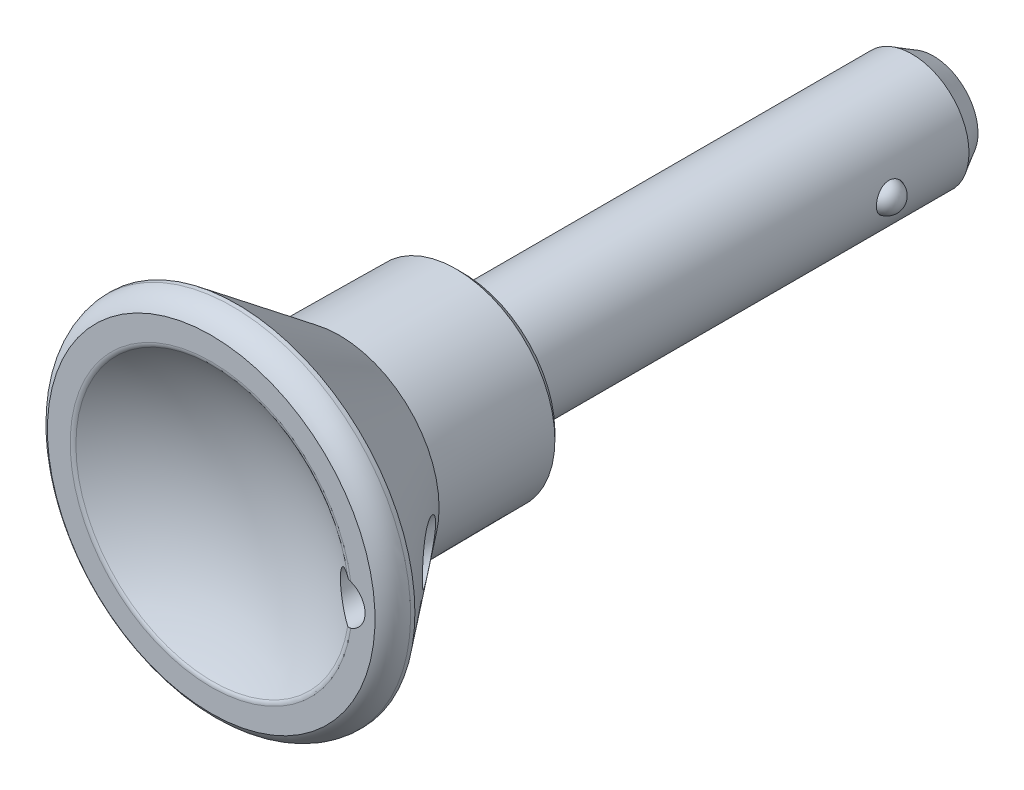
ISO-10303-21;
HEADER;
FILE_DESCRIPTION(('STEP AP214'),'2;1');
FILE_NAME('part.step','',(''),(''),'','','');
FILE_SCHEMA(('AUTOMOTIVE_DESIGN { 1 0 10303 214 1 1 1 1 }'));
ENDSEC;
DATA;
#1=APPLICATION_CONTEXT('core data for automotive mechanical design processes');
#2=APPLICATION_PROTOCOL_DEFINITION('international standard','automotive_design',2000,#1);
#3=PRODUCT_CONTEXT('',#1,'mechanical');
#4=PRODUCT('Part','Part','',(#3));
#5=PRODUCT_RELATED_PRODUCT_CATEGORY('part','',(#4));
#6=PRODUCT_DEFINITION_FORMATION('','',#4);
#7=PRODUCT_DEFINITION_CONTEXT('part definition',#1,'design');
#8=PRODUCT_DEFINITION('design','',#6,#7);
#9=PRODUCT_DEFINITION_SHAPE('','',#8);
#10=(LENGTH_UNIT() NAMED_UNIT(*) SI_UNIT(.MILLI.,.METRE.));
#11=(NAMED_UNIT(*) PLANE_ANGLE_UNIT() SI_UNIT($,.RADIAN.));
#12=(NAMED_UNIT(*) SI_UNIT($,.STERADIAN.) SOLID_ANGLE_UNIT());
#13=UNCERTAINTY_MEASURE_WITH_UNIT(LENGTH_MEASURE(1.E-05),#10,'distance_accuracy_value','');
#14=(GEOMETRIC_REPRESENTATION_CONTEXT(3) GLOBAL_UNCERTAINTY_ASSIGNED_CONTEXT((#13)) GLOBAL_UNIT_ASSIGNED_CONTEXT((#10,
#11,#12)) REPRESENTATION_CONTEXT('',''));
#15=CARTESIAN_POINT('',(0.,0.,0.));
#16=DIRECTION('',(0.,0.,1.));
#17=DIRECTION('',(1.,0.,0.));
#18=AXIS2_PLACEMENT_3D('',#15,#16,#17);
#19=CARTESIAN_POINT('',(0.,0.,0.));
#20=DIRECTION('',(0.,0.,1.));
#21=DIRECTION('',(0.,-1.,0.));
#22=AXIS2_PLACEMENT_3D('',#19,#20,#21);
#23=CYLINDRICAL_SURFACE('',#22,4.);
#24=CARTESIAN_POINT('',(0.,0.,0.));
#25=DIRECTION('',(0.,0.,1.));
#26=DIRECTION('',(0.,-1.,0.));
#27=AXIS2_PLACEMENT_3D('',#24,#25,#26);
#28=CIRCLE('',#27,4.);
#29=CARTESIAN_POINT('',(0.,-4.,0.));
#30=VERTEX_POINT('',#29);
#31=EDGE_CURVE('E18',#30,#30,#28,.T.);
#32=ORIENTED_EDGE('',*,*,#31,.F.);
#33=EDGE_LOOP('',(#32));
#34=FACE_BOUND('',#33,.T.);
#35=CARTESIAN_POINT('',(0.,0.,-31.5));
#36=DIRECTION('',(0.,0.,1.));
#37=DIRECTION('',(1.,0.,0.));
#38=AXIS2_PLACEMENT_3D('',#35,#36,#37);
#39=CIRCLE('',#38,4.);
#40=CARTESIAN_POINT('',(4.,0.,-31.5));
#41=VERTEX_POINT('',#40);
#42=EDGE_CURVE('E118',#41,#41,#39,.T.);
#43=ORIENTED_EDGE('',*,*,#42,.T.);
#44=EDGE_LOOP('',(#43));
#45=FACE_BOUND('',#44,.T.);
#46=CARTESIAN_POINT('',(3.88177455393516,0.965311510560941,-25.7388991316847));
#47=CARTESIAN_POINT('',(3.87947589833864,0.974537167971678,-25.7717537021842));
#48=CARTESIAN_POINT('',(3.87758596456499,0.982015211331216,-25.805105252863));
#49=CARTESIAN_POINT('',(3.87470673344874,0.993322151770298,-25.8719408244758));
#50=CARTESIAN_POINT('',(3.8737042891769,0.997204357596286,-25.9054152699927));
#51=CARTESIAN_POINT('',(3.87228725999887,1.00270077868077,-25.9925132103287));
#52=CARTESIAN_POINT('',(3.87257020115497,1.00161876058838,-26.0463531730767));
#53=CARTESIAN_POINT('',(3.87471439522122,0.993273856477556,-26.1269570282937));
#54=CARTESIAN_POINT('',(3.87573945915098,0.989279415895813,-26.1541316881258));
#55=CARTESIAN_POINT('',(3.87834788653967,0.97900141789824,-26.2080101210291));
#56=CARTESIAN_POINT('',(3.87993110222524,0.972718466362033,-26.2347140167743));
#57=CARTESIAN_POINT('',(3.88177455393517,0.965311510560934,-26.2611008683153));
#58=B_SPLINE_CURVE_WITH_KNOTS('',3,(#46,#47,#48,#49,#50,#51,#52,#53,#54,#55,#56,#57),
.UNSPECIFIED.,.F.,.F.,(4,2,2,2,2,4),(0.,0.10251399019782,0.203482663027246,0.364121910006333,
0.446491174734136,0.528838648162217),.UNSPECIFIED.);
#59=CARTESIAN_POINT('',(3.88177451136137,0.965311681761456,-25.7388997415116));
#60=VERTEX_POINT('',#59);
#61=CARTESIAN_POINT('',(3.88177446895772,0.965311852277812,-26.2610996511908));
#62=VERTEX_POINT('',#61);
#63=EDGE_CURVE('E73',#60,#62,#58,.T.);
#64=ORIENTED_EDGE('',*,*,#63,.T.);
#65=CARTESIAN_POINT('',(3.88177448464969,0.965311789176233,-26.2610998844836));
#66=CARTESIAN_POINT('',(3.88540385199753,0.950638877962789,-26.3155094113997));
#67=CARTESIAN_POINT('',(3.89014046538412,0.931319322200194,-26.3685420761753));
#68=CARTESIAN_POINT('',(3.90112983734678,0.884199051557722,-26.4704413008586));
#69=CARTESIAN_POINT('',(3.90738045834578,0.856410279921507,-26.5193136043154));
#70=CARTESIAN_POINT('',(3.92071189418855,0.793126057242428,-26.6116284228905));
#71=CARTESIAN_POINT('',(3.92779250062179,0.757632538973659,-26.6550722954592));
#72=CARTESIAN_POINT('',(3.94199278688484,0.679892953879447,-26.7354385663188));
#73=CARTESIAN_POINT('',(3.94911247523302,0.637645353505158,-26.7723594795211));
#74=CARTESIAN_POINT('',(3.96270366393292,0.546907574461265,-26.8391103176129));
#75=CARTESIAN_POINT('',(3.96916547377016,0.498343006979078,-26.8688412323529));
#76=CARTESIAN_POINT('',(3.9806028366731,0.396745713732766,-26.9196822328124));
#77=CARTESIAN_POINT('',(3.98557913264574,0.343715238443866,-26.9407966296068));
#78=CARTESIAN_POINT('',(3.99291972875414,0.242471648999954,-26.9713879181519));
#79=CARTESIAN_POINT('',(3.99555479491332,0.194645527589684,-26.9820925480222));
#80=CARTESIAN_POINT('',(3.99909511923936,0.0978826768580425,-26.9963986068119));
#81=CARTESIAN_POINT('',(4.00000061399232,0.0489461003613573,-27.0000010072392));
#82=CARTESIAN_POINT('',(3.99999930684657,-0.0552566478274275,-26.999998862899));
#83=CARTESIAN_POINT('',(3.99884379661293,-0.11052543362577,-26.9954052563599));
#84=CARTESIAN_POINT('',(3.99434700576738,-0.21947578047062,-26.9771816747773));
#85=CARTESIAN_POINT('',(3.9910047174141,-0.273156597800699,-26.9635475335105));
#86=CARTESIAN_POINT('',(3.98250420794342,-0.377347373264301,-26.9277072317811));
#87=CARTESIAN_POINT('',(3.97734807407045,-0.427860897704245,-26.9055109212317));
#88=CARTESIAN_POINT('',(3.96576893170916,-0.524447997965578,-26.8532124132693));
#89=CARTESIAN_POINT('',(3.95934587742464,-0.570521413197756,-26.8231099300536));
#90=CARTESIAN_POINT('',(3.94578204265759,-0.657873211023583,-26.7551953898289));
#91=CARTESIAN_POINT('',(3.93863012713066,-0.69904636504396,-26.7172502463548));
#92=CARTESIAN_POINT('',(3.92448848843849,-0.774509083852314,-26.6350198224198));
#93=CARTESIAN_POINT('',(3.91749874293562,-0.808799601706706,-26.5907354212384));
#94=CARTESIAN_POINT('',(3.90495270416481,-0.867284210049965,-26.5004846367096));
#95=CARTESIAN_POINT('',(3.8993282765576,-0.892041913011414,-26.4548922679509));
#96=CARTESIAN_POINT('',(3.88941506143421,-0.934286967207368,-26.3602904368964));
#97=CARTESIAN_POINT('',(3.88512710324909,-0.951769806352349,-26.3112788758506));
#98=CARTESIAN_POINT('',(3.88177448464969,-0.965311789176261,-26.2610998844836));
#99=B_SPLINE_CURVE_WITH_KNOTS('',3,(#65,#66,#67,#68,#69,#70,#71,#72,#73,#74,#75,#76,#77,#78,#79,
#80,#81,#82,#83,#84,#85,#86,#87,#88,#89,#90,#91,#92,#93,#94,#95,#96,#97,#98),.UNSPECIFIED.,.F.,
.F.,(4,2,2,2,2,2,2,2,2,2,2,2,2,2,2,2,4),(0.,0.169132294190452,0.338027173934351,
0.50687973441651,0.675770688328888,0.846869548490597,1.01788269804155,1.16458276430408,
1.31126276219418,1.47685399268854,1.64252158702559,1.80799916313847,1.97348272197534,
2.14204685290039,2.31058762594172,2.46651284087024,2.62253462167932),.UNSPECIFIED.);
#100=CARTESIAN_POINT('',(3.88177451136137,-0.965311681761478,-26.2611002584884));
#101=VERTEX_POINT('',#100);
#102=EDGE_CURVE('E57',#62,#101,#99,.T.);
#103=ORIENTED_EDGE('',*,*,#102,.T.);
#104=CARTESIAN_POINT('',(3.88177455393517,-0.965311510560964,-26.2611008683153));
#105=CARTESIAN_POINT('',(3.87947589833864,-0.974537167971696,-26.2282462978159));
#106=CARTESIAN_POINT('',(3.87758596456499,-0.982015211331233,-26.1948947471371));
#107=CARTESIAN_POINT('',(3.87470673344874,-0.993322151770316,-26.1280591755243));
#108=CARTESIAN_POINT('',(3.8737042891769,-0.997204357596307,-26.0945847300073));
#109=CARTESIAN_POINT('',(3.87228725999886,-1.00270077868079,-26.0074867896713));
#110=CARTESIAN_POINT('',(3.87257020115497,-1.0016187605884,-25.9536468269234));
#111=CARTESIAN_POINT('',(3.87471439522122,-0.993273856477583,-25.8730429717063));
#112=CARTESIAN_POINT('',(3.87573945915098,-0.989279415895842,-25.8458683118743));
#113=CARTESIAN_POINT('',(3.87834788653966,-0.979001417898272,-25.791989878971));
#114=CARTESIAN_POINT('',(3.87993110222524,-0.972718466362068,-25.7652859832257));
#115=CARTESIAN_POINT('',(3.88177455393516,-0.965311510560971,-25.7388991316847));
#116=B_SPLINE_CURVE_WITH_KNOTS('',3,(#104,#105,#106,#107,#108,#109,#110,#111,#112,#113,#114,
#115),.UNSPECIFIED.,.F.,.F.,(4,2,2,2,2,4),(0.,0.102513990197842,0.203482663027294,
0.364121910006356,0.446491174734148,0.528838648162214),.UNSPECIFIED.);
#117=CARTESIAN_POINT('',(3.88177446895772,-0.965311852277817,-25.7389003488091));
#118=VERTEX_POINT('',#117);
#119=EDGE_CURVE('E65',#101,#118,#116,.T.);
#120=ORIENTED_EDGE('',*,*,#119,.T.);
#121=CARTESIAN_POINT('',(3.88177448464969,-0.965311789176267,-25.7389001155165));
#122=CARTESIAN_POINT('',(3.88540385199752,-0.950638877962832,-25.6844905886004));
#123=CARTESIAN_POINT('',(3.89014046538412,-0.931319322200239,-25.6314579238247));
#124=CARTESIAN_POINT('',(3.90112983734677,-0.884199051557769,-25.5295586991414));
#125=CARTESIAN_POINT('',(3.90738045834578,-0.856410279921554,-25.4806863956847));
#126=CARTESIAN_POINT('',(3.92071189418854,-0.793126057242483,-25.3883715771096));
#127=CARTESIAN_POINT('',(3.92779250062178,-0.757632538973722,-25.3449277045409));
#128=CARTESIAN_POINT('',(3.94199278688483,-0.679892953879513,-25.2645614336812));
#129=CARTESIAN_POINT('',(3.94911247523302,-0.637645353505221,-25.2276405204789));
#130=CARTESIAN_POINT('',(3.96270366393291,-0.546907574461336,-25.1608896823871));
#131=CARTESIAN_POINT('',(3.96916547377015,-0.498343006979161,-25.1311587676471));
#132=CARTESIAN_POINT('',(3.98060283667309,-0.396745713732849,-25.0803177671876));
#133=CARTESIAN_POINT('',(3.98557913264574,-0.343715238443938,-25.0592033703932));
#134=CARTESIAN_POINT('',(3.99291972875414,-0.242471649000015,-25.0286120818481));
#135=CARTESIAN_POINT('',(3.99555479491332,-0.194645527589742,-25.0179074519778));
#136=CARTESIAN_POINT('',(3.99909511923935,-0.0978826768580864,-25.0036013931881));
#137=CARTESIAN_POINT('',(4.00000061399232,-0.04894610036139,-24.9999989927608));
#138=CARTESIAN_POINT('',(3.99999930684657,0.0552566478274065,-25.000001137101));
#139=CARTESIAN_POINT('',(3.99884379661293,0.110525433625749,-25.0045947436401));
#140=CARTESIAN_POINT('',(3.99434700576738,0.219475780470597,-25.0228183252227));
#141=CARTESIAN_POINT('',(3.9910047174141,0.273156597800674,-25.0364524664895));
#142=CARTESIAN_POINT('',(3.98250420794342,0.377347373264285,-25.0722927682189));
#143=CARTESIAN_POINT('',(3.97734807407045,0.42786089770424,-25.0944890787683));
#144=CARTESIAN_POINT('',(3.96576893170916,0.524447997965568,-25.1467875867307));
#145=CARTESIAN_POINT('',(3.95934587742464,0.57052141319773,-25.1768900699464));
#146=CARTESIAN_POINT('',(3.94578204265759,0.657873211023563,-25.2448046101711));
#147=CARTESIAN_POINT('',(3.93863012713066,0.699046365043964,-25.2827497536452));
#148=CARTESIAN_POINT('',(3.92448848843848,0.774509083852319,-25.3649801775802));
#149=CARTESIAN_POINT('',(3.91749874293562,0.808799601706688,-25.4092645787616));
#150=CARTESIAN_POINT('',(3.90495270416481,0.867284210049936,-25.4995153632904));
#151=CARTESIAN_POINT('',(3.8993282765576,0.892041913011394,-25.5451077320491));
#152=CARTESIAN_POINT('',(3.8894150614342,0.934286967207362,-25.6397095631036));
#153=CARTESIAN_POINT('',(3.88512710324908,0.951769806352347,-25.6887211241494));
#154=CARTESIAN_POINT('',(3.88177448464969,0.965311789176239,-25.7389001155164));
#155=B_SPLINE_CURVE_WITH_KNOTS('',3,(#121,#122,#123,#124,#125,#126,#127,#128,#129,#130,#131,
#132,#133,#134,#135,#136,#137,#138,#139,#140,#141,#142,#143,#144,#145,#146,#147,#148,#149,#150,
#151,#152,#153,#154),.UNSPECIFIED.,.F.,.F.,(4,2,2,2,2,2,2,2,2,2,2,2,2,2,2,2,4),(0.,
0.169132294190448,0.338027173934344,0.5068797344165,0.675770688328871,0.846869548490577,
1.01788269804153,1.16458276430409,1.31126276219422,1.47685399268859,1.64252158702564,
1.80799916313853,1.97348272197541,2.14204685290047,2.31058762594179,2.46651284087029,
2.62253462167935),.UNSPECIFIED.);
#156=EDGE_CURVE('E71',#118,#60,#155,.T.);
#157=ORIENTED_EDGE('',*,*,#156,.T.);
#158=EDGE_LOOP('',(#64,#103,#120,#157));
#159=FACE_BOUND('',#158,.T.);
#160=ADVANCED_FACE('F15',(#34,#45,#159),#23,.T.);
#161=CARTESIAN_POINT('',(6.4240762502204,-6.50116727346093,0.));
#162=DIRECTION('',(0.,0.,-1.));
#163=DIRECTION('',(-1.,0.,0.));
#164=AXIS2_PLACEMENT_3D('',#161,#162,#163);
#165=PLANE('',#164);
#166=ORIENTED_EDGE('',*,*,#31,.T.);
#167=EDGE_LOOP('',(#166));
#168=FACE_BOUND('',#167,.T.);
#169=CARTESIAN_POINT('',(0.,0.,0.));
#170=DIRECTION('',(0.,0.,1.));
#171=DIRECTION('',(0.,-1.,0.));
#172=AXIS2_PLACEMENT_3D('',#169,#170,#171);
#173=CIRCLE('',#172,6.4240762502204);
#174=CARTESIAN_POINT('',(0.,-6.4240762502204,0.));
#175=VERTEX_POINT('',#174);
#176=EDGE_CURVE('E199',#175,#175,#173,.T.);
#177=ORIENTED_EDGE('',*,*,#176,.F.);
#178=EDGE_LOOP('',(#177));
#179=FACE_BOUND('',#178,.T.);
#180=ADVANCED_FACE('F222',(#168,#179),#165,.T.);
#181=CARTESIAN_POINT('',(0.,0.,0.));
#182=DIRECTION('',(0.,0.,1.));
#183=DIRECTION('',(0.,-1.,0.));
#184=AXIS2_PLACEMENT_3D('',#181,#182,#183);
#185=CONICAL_SURFACE('',#184,6.4240762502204,0.789761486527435);
#186=CARTESIAN_POINT('',(0.,0.,0.499980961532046));
#187=DIRECTION('',(0.,0.,-1.));
#188=DIRECTION('',(1.,0.,0.));
#189=AXIS2_PLACEMENT_3D('',#186,#187,#188);
#190=CIRCLE('',#189,6.92843951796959);
#191=CARTESIAN_POINT('',(6.92843951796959,0.,0.499980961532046));
#192=VERTEX_POINT('',#191);
#193=EDGE_CURVE('E193',#192,#192,#190,.F.);
#194=ORIENTED_EDGE('',*,*,#193,.F.);
#195=EDGE_LOOP('',(#194));
#196=FACE_BOUND('',#195,.T.);
#197=ORIENTED_EDGE('',*,*,#176,.T.);
#198=EDGE_LOOP('',(#197));
#199=FACE_BOUND('',#198,.T.);
#200=ADVANCED_FACE('F227',(#196,#199),#185,.T.);
#201=CARTESIAN_POINT('',(0.,0.,0.499980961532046));
#202=DIRECTION('',(0.,0.,1.));
#203=DIRECTION('',(0.,-1.,0.));
#204=AXIS2_PLACEMENT_3D('',#201,#202,#203);
#205=CONICAL_SURFACE('',#204,6.92843951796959,0.00872664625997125);
#206=CARTESIAN_POINT('',(0.,0.,8.7));
#207=DIRECTION('',(0.,0.,-1.));
#208=DIRECTION('',(1.,0.,0.));
#209=AXIS2_PLACEMENT_3D('',#206,#207,#208);
#210=CIRCLE('',#209,7.);
#211=CARTESIAN_POINT('',(7.,0.,8.7));
#212=VERTEX_POINT('',#211);
#213=EDGE_CURVE('E188',#212,#212,#210,.F.);
#214=ORIENTED_EDGE('',*,*,#213,.F.);
#215=EDGE_LOOP('',(#214));
#216=FACE_BOUND('',#215,.T.);
#217=ORIENTED_EDGE('',*,*,#193,.T.);
#218=EDGE_LOOP('',(#217));
#219=FACE_BOUND('',#218,.T.);
#220=ADVANCED_FACE('F301',(#216,#219),#205,.T.);
#221=CARTESIAN_POINT('',(0.,0.,16.2));
#222=DIRECTION('',(0.,0.,1.));
#223=DIRECTION('',(0.,-1.,0.));
#224=AXIS2_PLACEMENT_3D('',#221,#222,#223);
#225=CYLINDRICAL_SURFACE('',#224,12.5);
#226=CARTESIAN_POINT('',(0.,0.,15.9));
#227=DIRECTION('',(0.,0.,-1.));
#228=DIRECTION('',(1.,0.,0.));
#229=AXIS2_PLACEMENT_3D('',#226,#227,#228);
#230=CIRCLE('',#229,12.5);
#231=CARTESIAN_POINT('',(12.5,0.,15.9));
#232=VERTEX_POINT('',#231);
#233=EDGE_CURVE('E189',#232,#232,#230,.T.);
#234=ORIENTED_EDGE('',*,*,#233,.F.);
#235=EDGE_LOOP('',(#234));
#236=FACE_BOUND('',#235,.T.);
#237=CARTESIAN_POINT('',(0.,0.,16.2));
#238=DIRECTION('',(0.,0.,1.));
#239=DIRECTION('',(0.,-1.,0.));
#240=AXIS2_PLACEMENT_3D('',#237,#238,#239);
#241=CIRCLE('',#240,12.5);
#242=CARTESIAN_POINT('',(0.,-12.5,16.2));
#243=VERTEX_POINT('',#242);
#244=EDGE_CURVE('E184',#243,#243,#241,.T.);
#245=ORIENTED_EDGE('',*,*,#244,.F.);
#246=EDGE_LOOP('',(#245));
#247=FACE_BOUND('',#246,.T.);
#248=ADVANCED_FACE('F292',(#236,#247),#225,.T.);
#249=CARTESIAN_POINT('',(0.,0.,8.7));
#250=DIRECTION('',(0.,0.,1.));
#251=DIRECTION('',(0.,-1.,0.));
#252=AXIS2_PLACEMENT_3D('',#249,#250,#251);
#253=CONICAL_SURFACE('',#252,7.,0.65233090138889);
#254=CARTESIAN_POINT('',(9.05806451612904,-1.48036050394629,11.5515077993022));
#255=CARTESIAN_POINT('',(8.99141512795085,-1.46946825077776,11.4631001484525));
#256=CARTESIAN_POINT('',(8.92550148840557,-1.45408557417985,11.3746905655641));
#257=CARTESIAN_POINT('',(8.79556366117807,-1.41427171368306,11.1984472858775));
#258=CARTESIAN_POINT('',(8.73154031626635,-1.38983655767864,11.1106138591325));
#259=CARTESIAN_POINT('',(8.60623315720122,-1.33170423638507,10.9367585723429));
#260=CARTESIAN_POINT('',(8.54493725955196,-1.29805393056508,10.8507298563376));
#261=CARTESIAN_POINT('',(8.42544336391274,-1.22074353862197,10.6811358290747));
#262=CARTESIAN_POINT('',(8.36724184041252,-1.17709515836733,10.5975677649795));
#263=CARTESIAN_POINT('',(8.2692294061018,-1.09114708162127,10.4552980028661));
#264=CARTESIAN_POINT('',(8.22852162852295,-1.05135683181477,10.3957022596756));
#265=CARTESIAN_POINT('',(8.14989980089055,-0.964725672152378,10.2796936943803));
#266=CARTESIAN_POINT('',(8.11198828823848,-0.917878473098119,10.2232837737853));
#267=CARTESIAN_POINT('',(8.03963417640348,-0.815744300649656,10.1148327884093));
#268=CARTESIAN_POINT('',(8.00522654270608,-0.76038393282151,10.0628364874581));
#269=CARTESIAN_POINT('',(7.94192848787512,-0.640477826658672,9.96655825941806));
#270=CARTESIAN_POINT('',(7.91302454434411,-0.575955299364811,9.92225744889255));
#271=CARTESIAN_POINT('',(7.87251252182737,-0.46305741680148,9.85986137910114));
#272=CARTESIAN_POINT('',(7.85846623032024,-0.417573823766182,9.83814176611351));
#273=CARTESIAN_POINT('',(7.83441768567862,-0.323152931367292,9.80086955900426));
#274=CARTESIAN_POINT('',(7.82440740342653,-0.274222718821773,9.78530472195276));
#275=CARTESIAN_POINT('',(7.81132335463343,-0.187620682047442,9.76493500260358));
#276=CARTESIAN_POINT('',(7.80710048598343,-0.150537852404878,9.75835039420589));
#277=CARTESIAN_POINT('',(7.80143783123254,-0.0756412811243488,9.74951765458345));
#278=CARTESIAN_POINT('',(7.79999798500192,-0.0378275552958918,9.7472694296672));
#279=CARTESIAN_POINT('',(7.8000025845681,0.0485200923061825,9.7472769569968));
#280=CARTESIAN_POINT('',(7.80237736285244,0.0970629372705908,9.75098545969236));
#281=CARTESIAN_POINT('',(7.81164444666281,0.192651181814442,9.76543406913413));
#282=CARTESIAN_POINT('',(7.81854204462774,0.239694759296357,9.77618241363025));
#283=CARTESIAN_POINT('',(7.83829683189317,0.341610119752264,9.80688772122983));
#284=CARTESIAN_POINT('',(7.85215507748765,0.395817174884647,9.82838678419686));
#285=CARTESIAN_POINT('',(7.8845198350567,0.499375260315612,9.87838349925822));
#286=CARTESIAN_POINT('',(7.90303499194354,0.548717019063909,9.9068941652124));
#287=CARTESIAN_POINT('',(7.95423062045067,0.667068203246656,9.98533549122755));
#288=CARTESIAN_POINT('',(7.9892435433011,0.732796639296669,10.0386516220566));
#289=CARTESIAN_POINT('',(8.06472209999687,0.853932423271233,10.1525776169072));
#290=CARTESIAN_POINT('',(8.10520064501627,0.909314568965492,10.2132047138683));
#291=CARTESIAN_POINT('',(8.18383548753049,1.00367842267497,10.3298982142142));
#292=CARTESIAN_POINT('',(8.22147534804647,1.04387385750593,10.3853483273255));
#293=CARTESIAN_POINT('',(8.29898008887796,1.11841530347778,10.4986148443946));
#294=CARTESIAN_POINT('',(8.33884646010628,1.15275733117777,10.556432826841));
#295=CARTESIAN_POINT('',(8.42042546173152,1.21614962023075,10.6737908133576));
#296=CARTESIAN_POINT('',(8.46214099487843,1.24519116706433,10.7333334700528));
#297=CARTESIAN_POINT('',(8.54706483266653,1.29830522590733,10.8535675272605));
#298=CARTESIAN_POINT('',(8.59027353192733,1.32237641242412,10.9142592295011));
#299=CARTESIAN_POINT('',(8.69675324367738,1.37513054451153,11.0626135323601));
#300=CARTESIAN_POINT('',(8.76068198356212,1.40136483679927,11.150681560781));
#301=CARTESIAN_POINT('',(8.89058399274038,1.4446681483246,11.3275915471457));
#302=CARTESIAN_POINT('',(8.95655819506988,1.46173291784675,11.4164338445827));
#303=CARTESIAN_POINT('',(9.09008194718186,1.48679092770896,11.5942301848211));
#304=CARTESIAN_POINT('',(9.15763151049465,1.49478409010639,11.683184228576));
#305=CARTESIAN_POINT('',(9.29378809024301,1.50153429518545,11.8605390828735));
#306=CARTESIAN_POINT('',(9.36239469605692,1.50029483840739,11.9489400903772));
#307=CARTESIAN_POINT('',(9.53896432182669,1.48478544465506,12.1740527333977));
#308=CARTESIAN_POINT('',(9.64741582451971,1.46359594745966,12.3100469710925));
#309=CARTESIAN_POINT('',(9.80896256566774,1.41213790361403,12.5095339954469));
#310=CARTESIAN_POINT('',(9.86259038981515,1.39172486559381,12.5752398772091));
#311=CARTESIAN_POINT('',(9.96902195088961,1.34380635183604,12.7046889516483));
#312=CARTESIAN_POINT('',(10.021826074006,1.31630431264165,12.7684330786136));
#313=CARTESIAN_POINT('',(10.1398540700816,1.24522266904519,12.9099256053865));
#314=CARTESIAN_POINT('',(10.2046458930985,1.1993124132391,12.9868895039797));
#315=CARTESIAN_POINT('',(10.3299573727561,1.09357010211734,13.1345591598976));
#316=CARTESIAN_POINT('',(10.3904821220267,1.03375502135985,13.2052724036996));
#317=CARTESIAN_POINT('',(10.4895745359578,0.916081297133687,13.3202576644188));
#318=CARTESIAN_POINT('',(10.5297805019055,0.861692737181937,13.3666468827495));
#319=CARTESIAN_POINT('',(10.6043536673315,0.743973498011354,13.452316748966));
#320=CARTESIAN_POINT('',(10.6387288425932,0.680655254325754,13.4916071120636));
#321=CARTESIAN_POINT('',(10.6925693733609,0.560424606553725,13.5529446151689));
#322=CARTESIAN_POINT('',(10.7136506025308,0.50520820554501,13.5768833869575));
#323=CARTESIAN_POINT('',(10.7495749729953,0.390302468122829,13.6176027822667));
#324=CARTESIAN_POINT('',(10.7644289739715,0.330621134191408,13.6343958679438));
#325=CARTESIAN_POINT('',(10.7836092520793,0.225596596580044,13.656059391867));
#326=CARTESIAN_POINT('',(10.7897268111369,0.180990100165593,13.6629607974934));
#327=CARTESIAN_POINT('',(10.7979243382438,0.0909301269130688,13.6722061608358));
#328=CARTESIAN_POINT('',(10.8000037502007,0.0454765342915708,13.6745494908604));
#329=CARTESIAN_POINT('',(10.799994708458,-0.0641674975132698,13.6745397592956));
#330=CARTESIAN_POINT('',(10.795841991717,-0.128380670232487,13.6698606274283));
#331=CARTESIAN_POINT('',(10.7796239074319,-0.254506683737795,13.6515601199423));
#332=CARTESIAN_POINT('',(10.7675483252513,-0.31641644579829,13.6379272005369));
#333=CARTESIAN_POINT('',(10.7366563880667,-0.435644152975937,13.6029693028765));
#334=CARTESIAN_POINT('',(10.7178919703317,-0.492993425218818,13.5817035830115));
#335=CARTESIAN_POINT('',(10.6748799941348,-0.602645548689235,13.532811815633));
#336=CARTESIAN_POINT('',(10.6506301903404,-0.654946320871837,13.5051831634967));
#337=CARTESIAN_POINT('',(10.5859735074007,-0.77647271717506,13.4312530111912));
#338=CARTESIAN_POINT('',(10.5432056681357,-0.842728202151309,13.3821425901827));
#339=CARTESIAN_POINT('',(10.4516580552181,-0.964099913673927,13.2763616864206));
#340=CARTESIAN_POINT('',(10.4028645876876,-1.01918998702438,13.2196739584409));
#341=CARTESIAN_POINT('',(10.2766029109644,-1.14345503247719,13.0719673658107));
#342=CARTESIAN_POINT('',(10.1967753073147,-1.20635475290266,12.9777102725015));
#343=CARTESIAN_POINT('',(10.0329696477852,-1.31236147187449,12.7820645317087));
#344=CARTESIAN_POINT('',(9.94898466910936,-1.35543413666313,12.6806638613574));
#345=CARTESIAN_POINT('',(9.79718248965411,-1.41705079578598,12.4951419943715));
#346=CARTESIAN_POINT('',(9.72964852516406,-1.43883766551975,12.4118303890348));
#347=CARTESIAN_POINT('',(9.59439459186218,-1.47247845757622,12.2433068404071));
#348=CARTESIAN_POINT('',(9.52667453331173,-1.48432617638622,12.1580937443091));
#349=CARTESIAN_POINT('',(9.39151350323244,-1.49875216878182,11.9862568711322));
#350=CARTESIAN_POINT('',(9.32407407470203,-1.50130123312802,11.8996295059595));
#351=CARTESIAN_POINT('',(9.19020636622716,-1.49747387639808,11.725837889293));
#352=CARTESIAN_POINT('',(9.12377782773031,-1.49109977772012,11.6386737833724));
#353=CARTESIAN_POINT('',(9.05806451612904,-1.48036050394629,11.5515077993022));
#354=B_SPLINE_CURVE_WITH_KNOTS('',3,(#254,#255,#256,#257,#258,#259,#260,#261,#262,#263,#264,
#265,#266,#267,#268,#269,#270,#271,#272,#273,#274,#275,#276,#277,#278,#279,#280,#281,#282,#283,
#284,#285,#286,#287,#288,#289,#290,#291,#292,#293,#294,#295,#296,#297,#298,#299,#300,#301,#302,
#303,#304,#305,#306,#307,#308,#309,#310,#311,#312,#313,#314,#315,#316,#317,#318,#319,#320,#321,
#322,#323,#324,#325,#326,#327,#328,#329,#330,#331,#332,#333,#334,#335,#336,#337,#338,#339,#340,
#341,#342,#343,#344,#345,#346,#347,#348,#349,#350,#351,#352,#353),.UNSPECIFIED.,.T.,.F.,(4,2,2,
2,2,2,2,2,2,2,2,2,2,2,2,2,2,2,2,2,2,2,2,2,2,2,2,2,2,2,2,2,2,2,2,2,2,2,2,2,2,2,2,2,2,2,2,2,2,4),
(0.,0.333658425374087,0.667463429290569,0.999601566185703,1.33135280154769,1.57826788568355,
1.82540433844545,2.07480511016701,2.32358497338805,2.4800563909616,2.63621497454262,
2.74958301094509,2.86294859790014,3.00835870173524,3.15393926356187,3.33275537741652,
3.51190592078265,3.78514778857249,4.0590467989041,4.29316938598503,4.52745067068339,
4.76211373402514,4.9968392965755,5.33221840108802,5.66775280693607,6.00329009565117,
6.338700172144,6.86226215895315,7.12372139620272,7.38505412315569,7.71589293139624,
8.04632996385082,8.29159071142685,8.5365132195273,8.72709088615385,8.91733480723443,
9.05359735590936,9.18987866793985,9.38217192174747,9.57471358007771,9.76579164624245,
9.95694806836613,10.2340958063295,10.5118854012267,10.9254412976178,11.3397106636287,
11.6675345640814,11.995562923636,12.3246208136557,12.6535930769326),.UNSPECIFIED.);
#355=CARTESIAN_POINT('',(9.05806451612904,-1.48036050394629,11.5515077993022));
#356=VERTEX_POINT('',#355);
#357=EDGE_CURVE('E154',#356,#356,#354,.T.);
#358=ORIENTED_EDGE('',*,*,#357,.F.);
#359=EDGE_LOOP('',(#358));
#360=FACE_BOUND('',#359,.T.);
#361=ORIENTED_EDGE('',*,*,#233,.T.);
#362=EDGE_LOOP('',(#361));
#363=FACE_BOUND('',#362,.T.);
#364=ORIENTED_EDGE('',*,*,#213,.T.);
#365=EDGE_LOOP('',(#364));
#366=FACE_BOUND('',#365,.T.);
#367=ADVANCED_FACE('F177',(#360,#363,#366),#253,.T.);
#368=CARTESIAN_POINT('',(0.,0.,15.9596620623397));
#369=DIRECTION('',(0.,0.,1.));
#370=DIRECTION('',(0.,-1.,0.));
#371=AXIS2_PLACEMENT_3D('',#368,#369,#370);
#372=TOROIDAL_SURFACE('',#371,10.5144930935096,2.);
#373=ORIENTED_EDGE('',*,*,#244,.T.);
#374=EDGE_LOOP('',(#373));
#375=FACE_BOUND('',#374,.T.);
#376=CARTESIAN_POINT('',(0.,0.,17.7));
#377=DIRECTION('',(0.,0.,1.));
#378=DIRECTION('',(0.,-1.,0.));
#379=AXIS2_PLACEMENT_3D('',#376,#377,#378);
#380=CIRCLE('',#379,11.5);
#381=CARTESIAN_POINT('',(0.,-11.5,17.7));
#382=VERTEX_POINT('',#381);
#383=EDGE_CURVE('E205',#382,#382,#380,.T.);
#384=ORIENTED_EDGE('',*,*,#383,.F.);
#385=EDGE_LOOP('',(#384));
#386=FACE_BOUND('',#385,.T.);
#387=ADVANCED_FACE('F169',(#375,#386),#372,.T.);
#388=CARTESIAN_POINT('',(9.3,0.,9.74688245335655));
#389=DIRECTION('',(0.,0.,1.));
#390=DIRECTION('',(0.,-1.,0.));
#391=AXIS2_PLACEMENT_3D('',#388,#389,#390);
#392=CYLINDRICAL_SURFACE('',#391,1.5);
#393=ORIENTED_EDGE('',*,*,#357,.T.);
#394=EDGE_LOOP('',(#393));
#395=FACE_BOUND('',#394,.T.);
#396=CARTESIAN_POINT('',(9.79838709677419,-1.41478277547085,17.7));
#397=CARTESIAN_POINT('',(9.76967463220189,-1.42493393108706,17.7000278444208));
#398=CARTESIAN_POINT('',(9.74057958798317,-1.43416331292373,17.6978154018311));
#399=CARTESIAN_POINT('',(9.68339626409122,-1.45046247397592,17.688811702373));
#400=CARTESIAN_POINT('',(9.65530246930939,-1.45758512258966,17.6821493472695));
#401=CARTESIAN_POINT('',(9.60265119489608,-1.46937623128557,17.6649718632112));
#402=CARTESIAN_POINT('',(9.5780018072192,-1.47420693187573,17.6548534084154));
#403=CARTESIAN_POINT('',(9.52973678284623,-1.48251466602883,17.6305344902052));
#404=CARTESIAN_POINT('',(9.50616459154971,-1.48595330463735,17.6162348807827));
#405=CARTESIAN_POINT('',(9.48387096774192,-1.48868783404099,17.6));
#406=B_SPLINE_CURVE_WITH_KNOTS('',3,(#396,#397,#398,#399,#400,#401,#402,#403,#404,#405),
.UNSPECIFIED.,.F.,.F.,(4,2,2,2,4),(0.,0.0913475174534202,0.180157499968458,0.261045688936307,
0.344033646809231),.UNSPECIFIED.);
#407=CARTESIAN_POINT('',(9.79838709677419,-1.41478277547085,17.7));
#408=VERTEX_POINT('',#407);
#409=CARTESIAN_POINT('',(9.48387096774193,-1.48868783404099,17.6));
#410=VERTEX_POINT('',#409);
#411=EDGE_CURVE('E145',#408,#410,#406,.T.);
#412=ORIENTED_EDGE('',*,*,#411,.F.);
#413=CARTESIAN_POINT('',(9.3,0.,17.7));
#414=DIRECTION('',(0.,0.,1.));
#415=DIRECTION('',(0.,-1.,0.));
#416=AXIS2_PLACEMENT_3D('',#413,#414,#415);
#417=CIRCLE('',#416,1.5);
#418=CARTESIAN_POINT('',(9.79838709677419,1.41478277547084,17.7));
#419=VERTEX_POINT('',#418);
#420=EDGE_CURVE('E32',#419,#408,#417,.F.);
#421=ORIENTED_EDGE('',*,*,#420,.F.);
#422=CARTESIAN_POINT('',(9.79838709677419,1.41478277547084,17.7));
#423=CARTESIAN_POINT('',(9.76967463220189,1.42493393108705,17.7000278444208));
#424=CARTESIAN_POINT('',(9.74057958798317,1.43416331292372,17.6978154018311));
#425=CARTESIAN_POINT('',(9.68339626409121,1.45046247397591,17.688811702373));
#426=CARTESIAN_POINT('',(9.65530246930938,1.45758512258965,17.6821493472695));
#427=CARTESIAN_POINT('',(9.60265119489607,1.46937623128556,17.6649718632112));
#428=CARTESIAN_POINT('',(9.57800180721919,1.47420693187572,17.6548534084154));
#429=CARTESIAN_POINT('',(9.52973678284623,1.48251466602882,17.6305344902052));
#430=CARTESIAN_POINT('',(9.50616459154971,1.48595330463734,17.6162348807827));
#431=CARTESIAN_POINT('',(9.48387096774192,1.48868783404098,17.6));
#432=B_SPLINE_CURVE_WITH_KNOTS('',3,(#422,#423,#424,#425,#426,#427,#428,#429,#430,#431),
.UNSPECIFIED.,.F.,.F.,(4,2,2,2,4),(0.,0.0913475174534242,0.180157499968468,0.261045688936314,
0.344033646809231),.UNSPECIFIED.);
#433=CARTESIAN_POINT('',(9.48387096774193,1.48868783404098,17.6));
#434=VERTEX_POINT('',#433);
#435=EDGE_CURVE('E137',#419,#434,#432,.T.);
#436=ORIENTED_EDGE('',*,*,#435,.T.);
#437=CARTESIAN_POINT('',(9.48387096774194,-1.48868783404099,17.6));
#438=CARTESIAN_POINT('',(9.38181447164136,-1.5012604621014,17.5258231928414));
#439=CARTESIAN_POINT('',(9.27847034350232,-1.50339409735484,17.4514075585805));
#440=CARTESIAN_POINT('',(9.07150168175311,-1.48616897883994,17.3036113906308));
#441=CARTESIAN_POINT('',(8.96788247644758,-1.46662385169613,17.230245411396));
#442=CARTESIAN_POINT('',(8.76570217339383,-1.40554015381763,17.0882393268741));
#443=CARTESIAN_POINT('',(8.66709675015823,-1.36425592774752,17.0195547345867));
#444=CARTESIAN_POINT('',(8.47807170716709,-1.25938003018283,16.8888158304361));
#445=CARTESIAN_POINT('',(8.38761877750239,-1.19588484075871,16.8267343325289));
#446=CARTESIAN_POINT('',(8.24568836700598,-1.0697955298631,16.7298945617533));
#447=CARTESIAN_POINT('',(8.19079097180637,-1.01295594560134,16.692612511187));
#448=CARTESIAN_POINT('',(8.08925811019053,-0.889102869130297,16.6238983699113));
#449=CARTESIAN_POINT('',(8.04262373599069,-0.822088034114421,16.5924670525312));
#450=CARTESIAN_POINT('',(7.95961243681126,-0.678453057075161,16.5366671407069));
#451=CARTESIAN_POINT('',(7.9233211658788,-0.601759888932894,16.5123574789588));
#452=CARTESIAN_POINT('',(7.86387797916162,-0.441385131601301,16.4726071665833));
#453=CARTESIAN_POINT('',(7.84069382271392,-0.357721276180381,16.4571447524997));
#454=CARTESIAN_POINT('',(7.81665644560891,-0.227526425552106,16.4411240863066));
#455=CARTESIAN_POINT('',(7.81042627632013,-0.182354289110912,16.4369745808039));
#456=CARTESIAN_POINT('',(7.80209606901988,-0.091465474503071,16.4314273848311));
#457=CARTESIAN_POINT('',(7.79999581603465,-0.0457488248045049,16.4300295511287));
#458=CARTESIAN_POINT('',(7.8000067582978,0.0738974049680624,16.4300365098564));
#459=CARTESIAN_POINT('',(7.80550430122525,0.147878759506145,16.4336949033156));
#460=CARTESIAN_POINT('',(7.82172596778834,0.257047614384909,16.4445026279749));
#461=CARTESIAN_POINT('',(7.82847272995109,0.293170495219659,16.4489987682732));
#462=CARTESIAN_POINT('',(7.84452794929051,0.364609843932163,16.4597055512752));
#463=CARTESIAN_POINT('',(7.85383787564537,0.399925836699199,16.4659171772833));
#464=CARTESIAN_POINT('',(7.88533418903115,0.503926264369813,16.4869492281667));
#465=CARTESIAN_POINT('',(7.91114789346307,0.571060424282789,16.5042071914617));
#466=CARTESIAN_POINT('',(7.97122958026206,0.699580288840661,16.5444764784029));
#467=CARTESIAN_POINT('',(8.00550445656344,0.760961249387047,16.5674924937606));
#468=CARTESIAN_POINT('',(8.06330229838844,0.849663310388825,16.6064232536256));
#469=CARTESIAN_POINT('',(8.08431449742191,0.879441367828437,16.6205962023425));
#470=CARTESIAN_POINT('',(8.12808579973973,0.936974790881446,16.6501700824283));
#471=CARTESIAN_POINT('',(8.15084283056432,0.964732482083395,16.6655695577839));
#472=CARTESIAN_POINT('',(8.22150377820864,1.04495101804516,16.7134720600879));
#473=CARTESIAN_POINT('',(8.27178709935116,1.09434151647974,16.7476721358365));
#474=CARTESIAN_POINT('',(8.38550726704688,1.19170689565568,16.8253434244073));
#475=CARTESIAN_POINT('',(8.44976642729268,1.2382209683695,16.8694253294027));
#476=CARTESIAN_POINT('',(8.58287694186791,1.31978473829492,16.961227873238));
#477=CARTESIAN_POINT('',(8.65173257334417,1.3548235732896,17.0089519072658));
#478=CARTESIAN_POINT('',(8.76337185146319,1.40144242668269,17.0867690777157));
#479=CARTESIAN_POINT('',(8.80522580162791,1.41674274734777,17.1160369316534));
#480=CARTESIAN_POINT('',(8.88962205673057,1.44344948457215,17.1752539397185));
#481=CARTESIAN_POINT('',(8.93216367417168,1.45485956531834,17.2052024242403));
#482=CARTESIAN_POINT('',(9.06048356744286,1.4833442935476,17.2958544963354));
#483=CARTESIAN_POINT('',(9.14699642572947,1.4946896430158,17.3573922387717));
#484=CARTESIAN_POINT('',(9.31725275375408,1.50223877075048,17.4793658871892));
#485=CARTESIAN_POINT('',(9.40099551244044,1.49891929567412,17.5397732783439));
#486=CARTESIAN_POINT('',(9.48387096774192,1.4886878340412,17.6));
#487=B_SPLINE_CURVE_WITH_KNOTS('',3,(#437,#438,#439,#440,#441,#442,#443,#444,#445,#446,#447,
#448,#449,#450,#451,#452,#453,#454,#455,#456,#457,#458,#459,#460,#461,#462,#463,#464,#465,#466,
#467,#468,#469,#470,#471,#472,#473,#474,#475,#476,#477,#478,#479,#480,#481,#482,#483,#484,#485,
#486),.UNSPECIFIED.,.F.,.F.,(4,2,2,2,2,2,2,2,2,2,2,2,2,2,2,2,2,2,2,2,2,2,2,2,4),(0.,
0.380173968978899,0.763641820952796,1.14271969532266,1.52017093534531,1.7812816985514,
2.0424269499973,2.30567583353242,2.5682743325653,2.70539664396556,2.84251181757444,
3.06399194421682,3.17494513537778,3.28596205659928,3.50680011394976,3.72781870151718,
3.84503226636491,3.96210870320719,4.19632161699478,4.4675973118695,4.73912905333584,
4.89893578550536,5.05859157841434,5.37775215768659,5.6866146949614),.UNSPECIFIED.);
#488=EDGE_CURVE('E153',#410,#434,#487,.T.);
#489=ORIENTED_EDGE('',*,*,#488,.F.);
#490=EDGE_LOOP('',(#412,#421,#436,#489));
#491=FACE_BOUND('',#490,.T.);
#492=ADVANCED_FACE('F164',(#395,#491),#392,.F.);
#493=CARTESIAN_POINT('',(0.,0.,30.4));
#494=DIRECTION('',(0.,-1.,0.));
#495=DIRECTION('',(0.,0.,1.));
#496=AXIS2_PLACEMENT_3D('',#493,#494,#495);
#497=SPHERICAL_SURFACE('',#496,16.);
#498=ORIENTED_EDGE('',*,*,#488,.T.);
#499=CARTESIAN_POINT('',(0.,0.,17.6));
#500=DIRECTION('',(0.,0.,1.));
#501=DIRECTION('',(0.,-1.,0.));
#502=AXIS2_PLACEMENT_3D('',#499,#500,#501);
#503=CIRCLE('',#502,9.6);
#504=EDGE_CURVE('E25',#410,#434,#503,.F.);
#505=ORIENTED_EDGE('',*,*,#504,.F.);
#506=EDGE_LOOP('',(#498,#505));
#507=FACE_BOUND('',#506,.T.);
#508=ADVANCED_FACE('F168',(#507),#497,.F.);
#509=CARTESIAN_POINT('',(-11.73,-11.4999999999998,17.7));
#510=CARTESIAN_POINT('',(-11.5,-11.4999999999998,17.7));
#511=CARTESIAN_POINT('',(11.5,-11.4999999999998,17.7));
#512=B_SPLINE_CURVE_WITH_KNOTS('',1,(#509,#510,#511),.UNSPECIFIED.,.F.,.F.,(2,1,2),(-0.01,0.,
1.),.UNSPECIFIED.);
#513=DIRECTION('',(0.,1.,0.));
#514=VECTOR('',#513,1.);
#515=SURFACE_OF_LINEAR_EXTRUSION('',#512,#514);
#516=ORIENTED_EDGE('',*,*,#420,.T.);
#517=CARTESIAN_POINT('',(0.,0.,17.7));
#518=DIRECTION('',(0.,0.,1.));
#519=DIRECTION('',(0.,-1.,0.));
#520=AXIS2_PLACEMENT_3D('',#517,#518,#519);
#521=CIRCLE('',#520,9.9);
#522=EDGE_CURVE('E9',#419,#408,#521,.T.);
#523=ORIENTED_EDGE('',*,*,#522,.F.);
#524=EDGE_LOOP('',(#516,#523));
#525=FACE_BOUND('',#524,.T.);
#526=ORIENTED_EDGE('',*,*,#383,.T.);
#527=EDGE_LOOP('',(#526));
#528=FACE_BOUND('',#527,.T.);
#529=ADVANCED_FACE('F132',(#525,#528),#515,.T.);
#530=CARTESIAN_POINT('',(0.,0.,17.2));
#531=DIRECTION('',(0.,0.,1.));
#532=DIRECTION('',(0.,-1.,0.));
#533=AXIS2_PLACEMENT_3D('',#530,#531,#532);
#534=TOROIDAL_SURFACE('',#533,9.89999999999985,0.50000000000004);
#535=ORIENTED_EDGE('',*,*,#435,.F.);
#536=ORIENTED_EDGE('',*,*,#522,.T.);
#537=ORIENTED_EDGE('',*,*,#411,.T.);
#538=ORIENTED_EDGE('',*,*,#504,.T.);
#539=EDGE_LOOP('',(#535,#536,#537,#538));
#540=FACE_BOUND('',#539,.T.);
#541=ADVANCED_FACE('F128',(#540),#534,.T.);
#542=CARTESIAN_POINT('',(3.13397459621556,-3.17158441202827,-33.));
#543=DIRECTION('',(0.,0.,-1.));
#544=DIRECTION('',(-1.,0.,0.));
#545=AXIS2_PLACEMENT_3D('',#542,#543,#544);
#546=PLANE('',#545);
#547=CARTESIAN_POINT('',(0.,0.,-33.));
#548=DIRECTION('',(0.,0.,1.));
#549=DIRECTION('',(0.,-1.,0.));
#550=AXIS2_PLACEMENT_3D('',#547,#548,#549);
#551=CIRCLE('',#550,3.13397459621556);
#552=CARTESIAN_POINT('',(0.,-3.13397459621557,-33.));
#553=VERTEX_POINT('',#552);
#554=EDGE_CURVE('E78',#553,#553,#551,.T.);
#555=ORIENTED_EDGE('',*,*,#554,.F.);
#556=EDGE_LOOP('',(#555));
#557=FACE_BOUND('',#556,.T.);
#558=ADVANCED_FACE('F104',(#557),#546,.T.);
#559=CARTESIAN_POINT('',(3.88177446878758,0.,-26.));
#560=DIRECTION('',(1.,0.,0.));
#561=DIRECTION('',(0.,-1.,0.));
#562=AXIS2_PLACEMENT_3D('',#559,#560,#561);
#563=CYLINDRICAL_SURFACE('',#562,1.);
#564=ORIENTED_EDGE('',*,*,#156,.F.);
#565=CARTESIAN_POINT('',(3.88177446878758,0.,-26.));
#566=DIRECTION('',(1.,0.,0.));
#567=DIRECTION('',(0.,-1.,0.));
#568=AXIS2_PLACEMENT_3D('',#565,#566,#567);
#569=CIRCLE('',#568,1.);
#570=EDGE_CURVE('E62',#118,#60,#569,.F.);
#571=ORIENTED_EDGE('',*,*,#570,.T.);
#572=EDGE_LOOP('',(#564,#571));
#573=FACE_BOUND('',#572,.T.);
#574=ADVANCED_FACE('F103',(#573),#563,.F.);
#575=CARTESIAN_POINT('',(3.88177446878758,0.,-26.));
#576=DIRECTION('',(1.,0.,0.));
#577=DIRECTION('',(0.,-1.,0.));
#578=AXIS2_PLACEMENT_3D('',#575,#576,#577);
#579=CYLINDRICAL_SURFACE('',#578,1.);
#580=CARTESIAN_POINT('',(3.88177446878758,0.,-26.));
#581=DIRECTION('',(1.,0.,0.));
#582=DIRECTION('',(0.,-1.,0.));
#583=AXIS2_PLACEMENT_3D('',#580,#581,#582);
#584=CIRCLE('',#583,1.);
#585=EDGE_CURVE('E53',#101,#62,#584,.T.);
#586=ORIENTED_EDGE('',*,*,#585,.F.);
#587=ORIENTED_EDGE('',*,*,#102,.F.);
#588=EDGE_LOOP('',(#586,#587));
#589=FACE_BOUND('',#588,.T.);
#590=ADVANCED_FACE('F55',(#589),#579,.F.);
#591=CARTESIAN_POINT('',(3.74,0.,-26.));
#592=DIRECTION('',(0.,-1.,0.));
#593=DIRECTION('',(0.,0.,-1.));
#594=AXIS2_PLACEMENT_3D('',#591,#592,#593);
#595=SPHERICAL_SURFACE('',#594,1.01);
#596=ORIENTED_EDGE('',*,*,#63,.F.);
#597=ORIENTED_EDGE('',*,*,#570,.F.);
#598=ORIENTED_EDGE('',*,*,#119,.F.);
#599=ORIENTED_EDGE('',*,*,#585,.T.);
#600=EDGE_LOOP('',(#596,#597,#598,#599));
#601=FACE_BOUND('',#600,.T.);
#602=ADVANCED_FACE('F66',(#601),#595,.T.);
#603=CARTESIAN_POINT('',(0.,0.,-33.));
#604=DIRECTION('',(0.,0.,1.));
#605=DIRECTION('',(0.,-1.,0.));
#606=AXIS2_PLACEMENT_3D('',#603,#604,#605);
#607=CONICAL_SURFACE('',#606,3.13397459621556,0.523598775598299);
#608=ORIENTED_EDGE('',*,*,#42,.F.);
#609=EDGE_LOOP('',(#608));
#610=FACE_BOUND('',#609,.T.);
#611=ORIENTED_EDGE('',*,*,#554,.T.);
#612=EDGE_LOOP('',(#611));
#613=FACE_BOUND('',#612,.T.);
#614=ADVANCED_FACE('F109',(#610,#613),#607,.T.);
#615=CLOSED_SHELL('',(#160,#180,#200,#220,#248,#367,#387,#492,#508,#529,#541,#558,#574,#590,
#602,#614));
#616=MANIFOLD_SOLID_BREP('B1',#615);
#617=ADVANCED_BREP_SHAPE_REPRESENTATION('',(#18,#616),#14);
#618=SHAPE_DEFINITION_REPRESENTATION(#9,#617);
ENDSEC;
END-ISO-10303-21;
